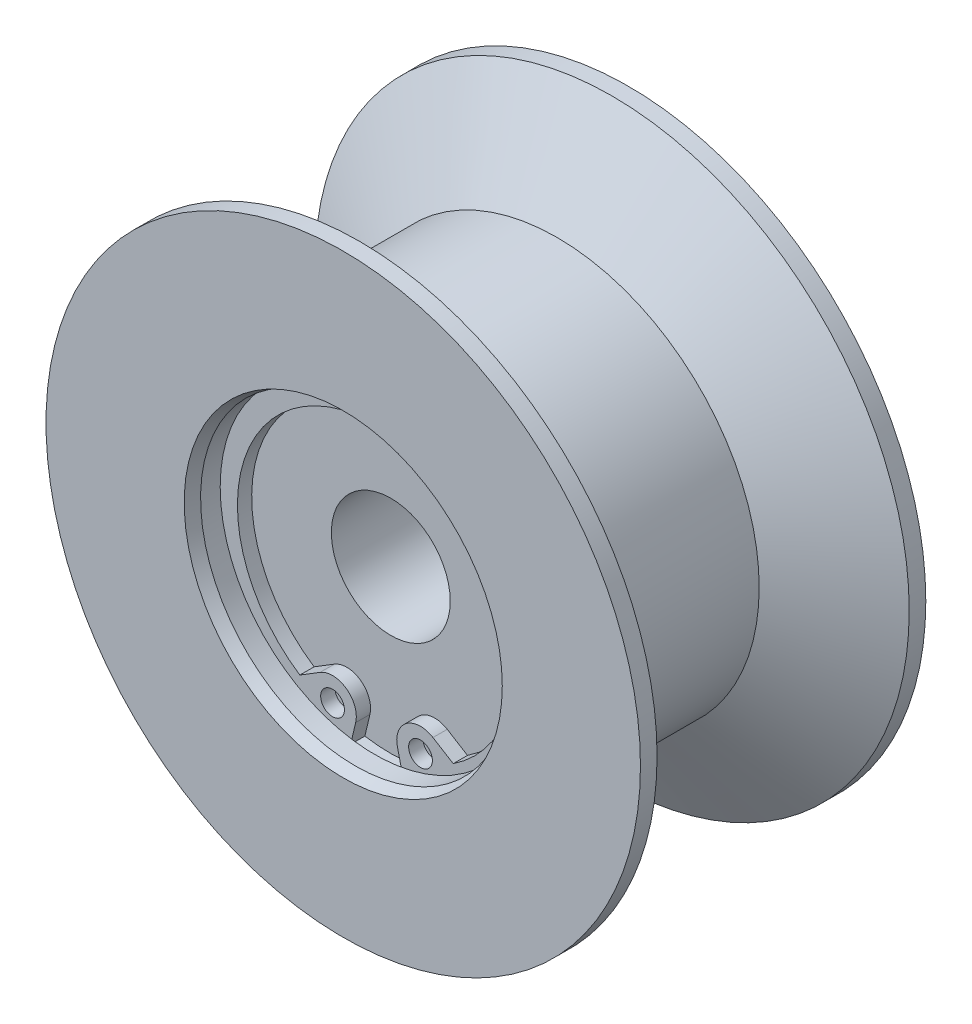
ISO-10303-21;
HEADER;
FILE_DESCRIPTION(('STEP AP214'),'2;1');
FILE_NAME('part.step','',(''),(''),'','','');
FILE_SCHEMA(('AUTOMOTIVE_DESIGN { 1 0 10303 214 1 1 1 1 }'));
ENDSEC;
DATA;
#1=APPLICATION_CONTEXT('core data for automotive mechanical design processes');
#2=APPLICATION_PROTOCOL_DEFINITION('international standard','automotive_design',2000,#1);
#3=PRODUCT_CONTEXT('',#1,'mechanical');
#4=PRODUCT('Part','Part','',(#3));
#5=PRODUCT_RELATED_PRODUCT_CATEGORY('part','',(#4));
#6=PRODUCT_DEFINITION_FORMATION('','',#4);
#7=PRODUCT_DEFINITION_CONTEXT('part definition',#1,'design');
#8=PRODUCT_DEFINITION('design','',#6,#7);
#9=PRODUCT_DEFINITION_SHAPE('','',#8);
#10=(LENGTH_UNIT() NAMED_UNIT(*) SI_UNIT(.MILLI.,.METRE.));
#11=(NAMED_UNIT(*) PLANE_ANGLE_UNIT() SI_UNIT($,.RADIAN.));
#12=(NAMED_UNIT(*) SI_UNIT($,.STERADIAN.) SOLID_ANGLE_UNIT());
#13=UNCERTAINTY_MEASURE_WITH_UNIT(LENGTH_MEASURE(1.E-05),#10,'distance_accuracy_value','');
#14=(GEOMETRIC_REPRESENTATION_CONTEXT(3) GLOBAL_UNCERTAINTY_ASSIGNED_CONTEXT((#13)) GLOBAL_UNIT_ASSIGNED_CONTEXT((#10,
#11,#12)) REPRESENTATION_CONTEXT('',''));
#15=CARTESIAN_POINT('',(0.,0.,0.));
#16=DIRECTION('',(0.,0.,1.));
#17=DIRECTION('',(1.,0.,0.));
#18=AXIS2_PLACEMENT_3D('',#15,#16,#17);
#19=CARTESIAN_POINT('',(-13.81055875,-13.7632,8.));
#20=DIRECTION('',(0.,0.,-1.));
#21=DIRECTION('',(0.,1.,0.));
#22=AXIS2_PLACEMENT_3D('',#19,#20,#21);
#23=PLANE('',#22);
#24=CARTESIAN_POINT('',(3.7,-11.165302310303,8.));
#25=DIRECTION('',(0.,0.,1.));
#26=DIRECTION('',(1.,0.,0.));
#27=AXIS2_PLACEMENT_3D('',#24,#25,#26);
#28=CIRCLE('',#27,1.);
#29=CARTESIAN_POINT('',(4.7,-11.165302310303,8.));
#30=VERTEX_POINT('',#29);
#31=EDGE_CURVE('E117',#30,#30,#28,.T.);
#32=ORIENTED_EDGE('',*,*,#31,.T.);
#33=EDGE_LOOP('',(#32));
#34=FACE_BOUND('',#33,.T.);
#35=ADVANCED_FACE('F14',(#34),#23,.F.);
#36=CARTESIAN_POINT('',(-3.7,-11.165302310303,8.));
#37=DIRECTION('',(0.,0.,-1.));
#38=DIRECTION('',(1.,0.,0.));
#39=AXIS2_PLACEMENT_3D('',#36,#37,#38);
#40=CIRCLE('',#39,1.);
#41=CARTESIAN_POINT('',(-2.7,-11.165302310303,8.));
#42=VERTEX_POINT('',#41);
#43=EDGE_CURVE('E142',#42,#42,#40,.T.);
#44=ORIENTED_EDGE('',*,*,#43,.F.);
#45=EDGE_LOOP('',(#44));
#46=FACE_BOUND('',#45,.T.);
#47=ADVANCED_FACE('F276',(#46),#23,.F.);
#48=CARTESIAN_POINT('',(0.,0.,-5.984827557));
#49=DIRECTION('',(0.,0.,1.));
#50=DIRECTION('',(1.,0.,0.));
#51=AXIS2_PLACEMENT_3D('',#48,#49,#50);
#52=CYLINDRICAL_SURFACE('',#51,16.99995471);
#53=CARTESIAN_POINT('',(0.,0.,5.984827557));
#54=DIRECTION('',(0.,0.,1.));
#55=DIRECTION('',(0.,-1.,0.));
#56=AXIS2_PLACEMENT_3D('',#53,#54,#55);
#57=CIRCLE('',#56,16.99995471);
#58=CARTESIAN_POINT('',(0.,-16.99995471,5.984827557));
#59=VERTEX_POINT('',#58);
#60=EDGE_CURVE('E175',#59,#59,#57,.F.);
#61=ORIENTED_EDGE('',*,*,#60,.T.);
#62=EDGE_LOOP('',(#61));
#63=FACE_BOUND('',#62,.T.);
#64=CARTESIAN_POINT('',(0.,0.,-5.98482755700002));
#65=DIRECTION('',(0.,0.,-1.));
#66=DIRECTION('',(0.,1.,0.));
#67=AXIS2_PLACEMENT_3D('',#64,#65,#66);
#68=CIRCLE('',#67,16.99995471);
#69=CARTESIAN_POINT('',(0.,16.99995471,-5.984827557));
#70=VERTEX_POINT('',#69);
#71=EDGE_CURVE('E182',#70,#70,#68,.T.);
#72=ORIENTED_EDGE('',*,*,#71,.F.);
#73=EDGE_LOOP('',(#72));
#74=FACE_BOUND('',#73,.T.);
#75=ADVANCED_FACE('F287',(#63,#74),#52,.T.);
#76=CARTESIAN_POINT('',(0.,0.,5.984827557));
#77=DIRECTION('',(0.,0.,1.));
#78=DIRECTION('',(1.,0.,0.));
#79=AXIS2_PLACEMENT_3D('',#76,#77,#78);
#80=CONICAL_SURFACE('',#79,16.99995471,1.04719755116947);
#81=CARTESIAN_POINT('',(0.,0.,10.6036558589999));
#82=DIRECTION('',(0.,0.,1.));
#83=DIRECTION('',(0.,-1.,0.));
#84=AXIS2_PLACEMENT_3D('',#81,#82,#83);
#85=CIRCLE('',#84,25.);
#86=CARTESIAN_POINT('',(0.,-25.,10.603655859));
#87=VERTEX_POINT('',#86);
#88=EDGE_CURVE('E185',#87,#87,#85,.F.);
#89=ORIENTED_EDGE('',*,*,#88,.T.);
#90=EDGE_LOOP('',(#89));
#91=FACE_BOUND('',#90,.T.);
#92=ORIENTED_EDGE('',*,*,#60,.F.);
#93=EDGE_LOOP('',(#92));
#94=FACE_BOUND('',#93,.T.);
#95=ADVANCED_FACE('F324',(#91,#94),#80,.T.);
#96=CARTESIAN_POINT('',(0.,0.,-5.984827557));
#97=DIRECTION('',(0.,0.,-1.));
#98=DIRECTION('',(-1.,0.,0.));
#99=AXIS2_PLACEMENT_3D('',#96,#97,#98);
#100=CONICAL_SURFACE('',#99,16.99995471,1.04719755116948);
#101=CARTESIAN_POINT('',(0.,0.,-10.6036558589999));
#102=DIRECTION('',(0.,0.,-1.));
#103=DIRECTION('',(0.,1.,0.));
#104=AXIS2_PLACEMENT_3D('',#101,#102,#103);
#105=CIRCLE('',#104,25.);
#106=CARTESIAN_POINT('',(0.,25.,-10.603655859));
#107=VERTEX_POINT('',#106);
#108=EDGE_CURVE('E143',#107,#107,#105,.F.);
#109=ORIENTED_EDGE('',*,*,#108,.T.);
#110=EDGE_LOOP('',(#109));
#111=FACE_BOUND('',#110,.T.);
#112=ORIENTED_EDGE('',*,*,#71,.T.);
#113=EDGE_LOOP('',(#112));
#114=FACE_BOUND('',#113,.T.);
#115=ADVANCED_FACE('F319',(#111,#114),#100,.T.);
#116=CARTESIAN_POINT('',(0.,0.,10.603655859));
#117=DIRECTION('',(0.,0.,1.));
#118=DIRECTION('',(1.,0.,0.));
#119=AXIS2_PLACEMENT_3D('',#116,#117,#118);
#120=CYLINDRICAL_SURFACE('',#119,25.);
#121=CARTESIAN_POINT('',(0.,0.,12.));
#122=DIRECTION('',(0.,0.,1.));
#123=DIRECTION('',(1.,0.,0.));
#124=AXIS2_PLACEMENT_3D('',#121,#122,#123);
#125=CIRCLE('',#124,25.);
#126=CARTESIAN_POINT('',(25.,0.,12.));
#127=VERTEX_POINT('',#126);
#128=EDGE_CURVE('E200',#127,#127,#125,.F.);
#129=ORIENTED_EDGE('',*,*,#128,.T.);
#130=EDGE_LOOP('',(#129));
#131=FACE_BOUND('',#130,.T.);
#132=ORIENTED_EDGE('',*,*,#88,.F.);
#133=EDGE_LOOP('',(#132));
#134=FACE_BOUND('',#133,.T.);
#135=ADVANCED_FACE('F315',(#131,#134),#120,.T.);
#136=CARTESIAN_POINT('',(0.,0.,-12.));
#137=DIRECTION('',(0.,0.,1.));
#138=DIRECTION('',(1.,0.,0.));
#139=AXIS2_PLACEMENT_3D('',#136,#137,#138);
#140=CYLINDRICAL_SURFACE('',#139,25.);
#141=ORIENTED_EDGE('',*,*,#108,.F.);
#142=EDGE_LOOP('',(#141));
#143=FACE_BOUND('',#142,.T.);
#144=CARTESIAN_POINT('',(0.,0.,-12.));
#145=DIRECTION('',(0.,0.,1.));
#146=DIRECTION('',(1.,0.,0.));
#147=AXIS2_PLACEMENT_3D('',#144,#145,#146);
#148=CIRCLE('',#147,25.);
#149=CARTESIAN_POINT('',(25.,0.,-12.));
#150=VERTEX_POINT('',#149);
#151=EDGE_CURVE('E178',#150,#150,#148,.T.);
#152=ORIENTED_EDGE('',*,*,#151,.T.);
#153=EDGE_LOOP('',(#152));
#154=FACE_BOUND('',#153,.T.);
#155=ADVANCED_FACE('F318',(#143,#154),#140,.T.);
#156=CARTESIAN_POINT('',(-25.387056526,-25.3,12.));
#157=DIRECTION('',(0.,0.,-1.));
#158=DIRECTION('',(0.,1.,0.));
#159=AXIS2_PLACEMENT_3D('',#156,#157,#158);
#160=PLANE('',#159);
#161=CARTESIAN_POINT('',(0.,0.,12.));
#162=DIRECTION('',(0.,0.,1.));
#163=DIRECTION('',(1.,0.,0.));
#164=AXIS2_PLACEMENT_3D('',#161,#162,#163);
#165=CIRCLE('',#164,13.377350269);
#166=CARTESIAN_POINT('',(13.377350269,0.,12.));
#167=VERTEX_POINT('',#166);
#168=EDGE_CURVE('E206',#167,#167,#165,.T.);
#169=ORIENTED_EDGE('',*,*,#168,.F.);
#170=EDGE_LOOP('',(#169));
#171=FACE_BOUND('',#170,.T.);
#172=ORIENTED_EDGE('',*,*,#128,.F.);
#173=EDGE_LOOP('',(#172));
#174=FACE_BOUND('',#173,.T.);
#175=ADVANCED_FACE('F333',(#171,#174),#160,.F.);
#176=CARTESIAN_POINT('',(-25.387056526,25.3,-12.));
#177=DIRECTION('',(0.,0.,1.));
#178=DIRECTION('',(0.,-1.,0.));
#179=AXIS2_PLACEMENT_3D('',#176,#177,#178);
#180=PLANE('',#179);
#181=CARTESIAN_POINT('',(0.,0.,-12.));
#182=DIRECTION('',(0.,0.,1.));
#183=DIRECTION('',(1.,0.,0.));
#184=AXIS2_PLACEMENT_3D('',#181,#182,#183);
#185=CIRCLE('',#184,11.);
#186=CARTESIAN_POINT('',(11.,0.,-12.));
#187=VERTEX_POINT('',#186);
#188=EDGE_CURVE('E179',#187,#187,#185,.F.);
#189=ORIENTED_EDGE('',*,*,#188,.F.);
#190=EDGE_LOOP('',(#189));
#191=FACE_BOUND('',#190,.T.);
#192=ORIENTED_EDGE('',*,*,#151,.F.);
#193=EDGE_LOOP('',(#192));
#194=FACE_BOUND('',#193,.T.);
#195=ADVANCED_FACE('F16',(#191,#194),#180,.F.);
#196=CARTESIAN_POINT('',(0.,0.,11.));
#197=DIRECTION('',(0.,0.,1.));
#198=DIRECTION('',(1.,0.,0.));
#199=AXIS2_PLACEMENT_3D('',#196,#197,#198);
#200=CONICAL_SURFACE('',#199,13.,0.360829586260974);
#201=CARTESIAN_POINT('',(0.,0.,11.));
#202=DIRECTION('',(0.,0.,1.));
#203=DIRECTION('',(0.,-1.,0.));
#204=AXIS2_PLACEMENT_3D('',#201,#202,#203);
#205=CIRCLE('',#204,13.);
#206=CARTESIAN_POINT('',(0.,-13.,11.));
#207=VERTEX_POINT('',#206);
#208=EDGE_CURVE('E189',#207,#207,#205,.T.);
#209=ORIENTED_EDGE('',*,*,#208,.F.);
#210=EDGE_LOOP('',(#209));
#211=FACE_BOUND('',#210,.T.);
#212=ORIENTED_EDGE('',*,*,#168,.T.);
#213=EDGE_LOOP('',(#212));
#214=FACE_BOUND('',#213,.T.);
#215=ADVANCED_FACE('F308',(#211,#214),#200,.F.);
#216=CARTESIAN_POINT('',(0.,0.,-12.));
#217=DIRECTION('',(0.,0.,1.));
#218=DIRECTION('',(1.,0.,0.));
#219=AXIS2_PLACEMENT_3D('',#216,#217,#218);
#220=CYLINDRICAL_SURFACE('',#219,11.);
#221=ORIENTED_EDGE('',*,*,#188,.T.);
#222=EDGE_LOOP('',(#221));
#223=FACE_BOUND('',#222,.T.);
#224=CARTESIAN_POINT('',(0.,0.,-8.));
#225=DIRECTION('',(0.,0.,1.));
#226=DIRECTION('',(1.,0.,0.));
#227=AXIS2_PLACEMENT_3D('',#224,#225,#226);
#228=CIRCLE('',#227,11.);
#229=CARTESIAN_POINT('',(11.,0.,-8.));
#230=VERTEX_POINT('',#229);
#231=EDGE_CURVE('E188',#230,#230,#228,.F.);
#232=ORIENTED_EDGE('',*,*,#231,.F.);
#233=EDGE_LOOP('',(#232));
#234=FACE_BOUND('',#233,.T.);
#235=ADVANCED_FACE('F306',(#223,#234),#220,.F.);
#236=CARTESIAN_POINT('',(0.,0.,9.35));
#237=DIRECTION('',(0.,0.,1.));
#238=DIRECTION('',(1.,0.,0.));
#239=AXIS2_PLACEMENT_3D('',#236,#237,#238);
#240=CYLINDRICAL_SURFACE('',#239,13.);
#241=CARTESIAN_POINT('',(0.,0.,9.35));
#242=DIRECTION('',(0.,0.,1.));
#243=DIRECTION('',(1.,0.,0.));
#244=AXIS2_PLACEMENT_3D('',#241,#242,#243);
#245=CIRCLE('',#244,13.);
#246=CARTESIAN_POINT('',(13.,0.,9.35));
#247=VERTEX_POINT('',#246);
#248=EDGE_CURVE('E213',#247,#247,#245,.T.);
#249=ORIENTED_EDGE('',*,*,#248,.F.);
#250=EDGE_LOOP('',(#249));
#251=FACE_BOUND('',#250,.T.);
#252=ORIENTED_EDGE('',*,*,#208,.T.);
#253=EDGE_LOOP('',(#252));
#254=FACE_BOUND('',#253,.T.);
#255=ADVANCED_FACE('F302',(#251,#254),#240,.F.);
#256=CARTESIAN_POINT('',(-11.170304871,11.132,-8.));
#257=DIRECTION('',(0.,0.,1.));
#258=DIRECTION('',(0.,-1.,0.));
#259=AXIS2_PLACEMENT_3D('',#256,#257,#258);
#260=PLANE('',#259);
#261=CARTESIAN_POINT('',(0.,0.,-8.));
#262=DIRECTION('',(0.,0.,1.));
#263=DIRECTION('',(1.,0.,0.));
#264=AXIS2_PLACEMENT_3D('',#261,#262,#263);
#265=CIRCLE('',#264,5.);
#266=CARTESIAN_POINT('',(5.,0.,-8.));
#267=VERTEX_POINT('',#266);
#268=EDGE_CURVE('E203',#267,#267,#265,.F.);
#269=ORIENTED_EDGE('',*,*,#268,.F.);
#270=EDGE_LOOP('',(#269));
#271=FACE_BOUND('',#270,.T.);
#272=ORIENTED_EDGE('',*,*,#231,.T.);
#273=EDGE_LOOP('',(#272));
#274=FACE_BOUND('',#273,.T.);
#275=ADVANCED_FACE('F305',(#271,#274),#260,.F.);
#276=CARTESIAN_POINT('',(-13.81055875,13.7632,9.35));
#277=DIRECTION('',(0.,0.,1.));
#278=DIRECTION('',(0.,-1.,0.));
#279=AXIS2_PLACEMENT_3D('',#276,#277,#278);
#280=PLANE('',#279);
#281=ORIENTED_EDGE('',*,*,#248,.T.);
#282=EDGE_LOOP('',(#281));
#283=FACE_BOUND('',#282,.T.);
#284=CARTESIAN_POINT('',(0.,0.,9.35));
#285=DIRECTION('',(0.,0.,1.));
#286=DIRECTION('',(1.,0.,0.));
#287=AXIS2_PLACEMENT_3D('',#284,#285,#286);
#288=CIRCLE('',#287,13.6);
#289=CARTESIAN_POINT('',(13.6,0.,9.35));
#290=VERTEX_POINT('',#289);
#291=EDGE_CURVE('E216',#290,#290,#288,.F.);
#292=ORIENTED_EDGE('',*,*,#291,.T.);
#293=EDGE_LOOP('',(#292));
#294=FACE_BOUND('',#293,.T.);
#295=ADVANCED_FACE('F220',(#283,#294),#280,.F.);
#296=CARTESIAN_POINT('',(0.,0.,8.));
#297=DIRECTION('',(0.,0.,1.));
#298=DIRECTION('',(1.,0.,0.));
#299=AXIS2_PLACEMENT_3D('',#296,#297,#298);
#300=CYLINDRICAL_SURFACE('',#299,13.6);
#301=ORIENTED_EDGE('',*,*,#291,.F.);
#302=EDGE_LOOP('',(#301));
#303=FACE_BOUND('',#302,.T.);
#304=DIRECTION('',(0.,0.,1.));
#305=VECTOR('',#304,1.);
#306=CARTESIAN_POINT('',(2.1813307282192,-13.4239262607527,8.));
#307=LINE('',#306,#305);
#308=CARTESIAN_POINT('',(2.1813307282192,-13.4239262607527,8.));
#309=VERTEX_POINT('',#308);
#310=CARTESIAN_POINT('',(2.18133072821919,-13.4239262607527,9.2));
#311=VERTEX_POINT('',#310);
#312=EDGE_CURVE('E18',#309,#311,#307,.T.);
#313=ORIENTED_EDGE('',*,*,#312,.F.);
#314=CARTESIAN_POINT('',(0.,0.,8.));
#315=DIRECTION('',(0.,0.,1.));
#316=DIRECTION('',(1.,0.,0.));
#317=AXIS2_PLACEMENT_3D('',#314,#315,#316);
#318=CIRCLE('',#317,13.6);
#319=CARTESIAN_POINT('',(-2.18133072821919,-13.4239262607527,8.));
#320=VERTEX_POINT('',#319);
#321=EDGE_CURVE('E193',#309,#320,#318,.F.);
#322=ORIENTED_EDGE('',*,*,#321,.T.);
#323=DIRECTION('',(0.,0.,1.));
#324=VECTOR('',#323,1.);
#325=CARTESIAN_POINT('',(-2.18133072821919,-13.4239262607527,8.));
#326=LINE('',#325,#324);
#327=CARTESIAN_POINT('',(-2.18133072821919,-13.4239262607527,9.2));
#328=VERTEX_POINT('',#327);
#329=EDGE_CURVE('E105',#328,#320,#326,.F.);
#330=ORIENTED_EDGE('',*,*,#329,.F.);
#331=CARTESIAN_POINT('',(0.,0.,9.2));
#332=DIRECTION('',(0.,0.,-1.));
#333=DIRECTION('',(-1.,0.,0.));
#334=AXIS2_PLACEMENT_3D('',#331,#332,#333);
#335=CIRCLE('',#334,13.6);
#336=EDGE_CURVE('E9',#311,#328,#335,.F.);
#337=ORIENTED_EDGE('',*,*,#336,.F.);
#338=EDGE_LOOP('',(#313,#322,#330,#337));
#339=FACE_BOUND('',#338,.T.);
#340=ADVANCED_FACE('F222',(#303,#339),#300,.F.);
#341=CARTESIAN_POINT('',(0.,0.,-8.));
#342=DIRECTION('',(0.,0.,1.));
#343=DIRECTION('',(1.,0.,0.));
#344=AXIS2_PLACEMENT_3D('',#341,#342,#343);
#345=CYLINDRICAL_SURFACE('',#344,5.);
#346=ORIENTED_EDGE('',*,*,#268,.T.);
#347=EDGE_LOOP('',(#346));
#348=FACE_BOUND('',#347,.T.);
#349=CARTESIAN_POINT('',(0.,0.,8.));
#350=DIRECTION('',(0.,0.,1.));
#351=DIRECTION('',(1.,0.,0.));
#352=AXIS2_PLACEMENT_3D('',#349,#350,#351);
#353=CIRCLE('',#352,5.);
#354=CARTESIAN_POINT('',(5.,0.,8.));
#355=VERTEX_POINT('',#354);
#356=EDGE_CURVE('E192',#355,#355,#353,.F.);
#357=ORIENTED_EDGE('',*,*,#356,.F.);
#358=EDGE_LOOP('',(#357));
#359=FACE_BOUND('',#358,.T.);
#360=ADVANCED_FACE('F224',(#348,#359),#345,.F.);
#361=ORIENTED_EDGE('',*,*,#356,.T.);
#362=EDGE_LOOP('',(#361));
#363=FACE_BOUND('',#362,.T.);
#364=ORIENTED_EDGE('',*,*,#321,.F.);
#365=DIRECTION('',(0.231349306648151,-0.972870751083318,0.));
#366=VECTOR('',#365,1.);
#367=CARTESIAN_POINT('',(1.75425849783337,-11.6280009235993,8.));
#368=LINE('',#367,#366);
#369=CARTESIAN_POINT('',(1.75425849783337,-11.6280009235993,8.));
#370=VERTEX_POINT('',#369);
#371=EDGE_CURVE('E34',#370,#309,#368,.T.);
#372=ORIENTED_EDGE('',*,*,#371,.F.);
#373=CARTESIAN_POINT('',(3.7,-11.165302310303,8.));
#374=DIRECTION('',(0.,0.,1.));
#375=DIRECTION('',(1.,0.,0.));
#376=AXIS2_PLACEMENT_3D('',#373,#374,#375);
#377=CIRCLE('',#376,2.);
#378=CARTESIAN_POINT('',(4.74866968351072,-9.46227797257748,8.));
#379=VERTEX_POINT('',#378);
#380=EDGE_CURVE('E137',#379,#370,#377,.T.);
#381=ORIENTED_EDGE('',*,*,#380,.F.);
#382=DIRECTION('',(-0.851512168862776,0.524334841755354,0.));
#383=VECTOR('',#382,1.);
#384=CARTESIAN_POINT('',(4.74866968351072,-9.46227797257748,8.));
#385=LINE('',#384,#383);
#386=CARTESIAN_POINT('',(6.45127454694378,-10.5106893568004,8.));
#387=VERTEX_POINT('',#386);
#388=EDGE_CURVE('E112',#387,#379,#385,.T.);
#389=ORIENTED_EDGE('',*,*,#388,.F.);
#390=CARTESIAN_POINT('',(0.,-0.75,8.));
#391=DIRECTION('',(0.,0.,-1.));
#392=DIRECTION('',(0.,-1.,0.));
#393=AXIS2_PLACEMENT_3D('',#390,#391,#392);
#394=CIRCLE('',#393,11.7);
#395=CARTESIAN_POINT('',(-6.45127454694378,-10.5106893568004,8.));
#396=VERTEX_POINT('',#395);
#397=EDGE_CURVE('E108',#396,#387,#394,.T.);
#398=ORIENTED_EDGE('',*,*,#397,.F.);
#399=DIRECTION('',(-0.851512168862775,-0.524334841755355,0.));
#400=VECTOR('',#399,1.);
#401=CARTESIAN_POINT('',(-4.74866968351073,-9.46227797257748,8.));
#402=LINE('',#401,#400);
#403=CARTESIAN_POINT('',(-4.74866968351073,-9.46227797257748,8.));
#404=VERTEX_POINT('',#403);
#405=EDGE_CURVE('E94',#404,#396,#402,.T.);
#406=ORIENTED_EDGE('',*,*,#405,.F.);
#407=CARTESIAN_POINT('',(-3.7,-11.165302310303,8.));
#408=DIRECTION('',(0.,0.,1.));
#409=DIRECTION('',(-1.,0.,0.));
#410=AXIS2_PLACEMENT_3D('',#407,#408,#409);
#411=CIRCLE('',#410,2.);
#412=CARTESIAN_POINT('',(-1.75425849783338,-11.6280009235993,8.));
#413=VERTEX_POINT('',#412);
#414=EDGE_CURVE('E148',#413,#404,#411,.T.);
#415=ORIENTED_EDGE('',*,*,#414,.F.);
#416=DIRECTION('',(0.231349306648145,0.97287075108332,0.));
#417=VECTOR('',#416,1.);
#418=CARTESIAN_POINT('',(-1.75425849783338,-11.6280009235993,8.));
#419=LINE('',#418,#417);
#420=EDGE_CURVE('E144',#320,#413,#419,.T.);
#421=ORIENTED_EDGE('',*,*,#420,.F.);
#422=EDGE_LOOP('',(#364,#372,#381,#389,#398,#406,#415,#421));
#423=FACE_BOUND('',#422,.T.);
#424=ADVANCED_FACE('F110',(#363,#423),#23,.F.);
#425=CARTESIAN_POINT('',(0.,-0.75,9.2));
#426=DIRECTION('',(0.,0.,1.));
#427=DIRECTION('',(-1.,0.,0.));
#428=AXIS2_PLACEMENT_3D('',#425,#426,#427);
#429=CYLINDRICAL_SURFACE('',#428,11.7);
#430=ORIENTED_EDGE('',*,*,#397,.T.);
#431=DIRECTION('',(0.,0.,-1.));
#432=VECTOR('',#431,1.);
#433=CARTESIAN_POINT('',(6.45127454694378,-10.5106893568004,9.2));
#434=LINE('',#433,#432);
#435=CARTESIAN_POINT('',(6.45127454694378,-10.5106893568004,9.2));
#436=VERTEX_POINT('',#435);
#437=EDGE_CURVE('E127',#436,#387,#434,.T.);
#438=ORIENTED_EDGE('',*,*,#437,.F.);
#439=CARTESIAN_POINT('',(0.,-0.75,9.2));
#440=DIRECTION('',(0.,0.,-1.));
#441=DIRECTION('',(0.,-1.,0.));
#442=AXIS2_PLACEMENT_3D('',#439,#440,#441);
#443=CIRCLE('',#442,11.7);
#444=CARTESIAN_POINT('',(-6.45127454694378,-10.5106893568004,9.2));
#445=VERTEX_POINT('',#444);
#446=EDGE_CURVE('E120',#445,#436,#443,.T.);
#447=ORIENTED_EDGE('',*,*,#446,.F.);
#448=DIRECTION('',(0.,0.,-1.));
#449=VECTOR('',#448,1.);
#450=CARTESIAN_POINT('',(-6.45127454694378,-10.5106893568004,9.2));
#451=LINE('',#450,#449);
#452=EDGE_CURVE('E98',#445,#396,#451,.T.);
#453=ORIENTED_EDGE('',*,*,#452,.T.);
#454=EDGE_LOOP('',(#430,#438,#447,#453));
#455=FACE_BOUND('',#454,.T.);
#456=ADVANCED_FACE('F119',(#455),#429,.F.);
#457=CARTESIAN_POINT('',(4.74866968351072,-9.46227797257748,9.2));
#458=DIRECTION('',(-0.524334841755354,-0.851512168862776,0.));
#459=DIRECTION('',(-0.851512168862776,0.524334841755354,0.));
#460=AXIS2_PLACEMENT_3D('',#457,#458,#459);
#461=PLANE('',#460);
#462=ORIENTED_EDGE('',*,*,#388,.T.);
#463=DIRECTION('',(0.,0.,-1.));
#464=VECTOR('',#463,1.);
#465=CARTESIAN_POINT('',(4.74866968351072,-9.46227797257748,9.2));
#466=LINE('',#465,#464);
#467=CARTESIAN_POINT('',(4.74866968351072,-9.46227797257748,9.2));
#468=VERTEX_POINT('',#467);
#469=EDGE_CURVE('E155',#468,#379,#466,.T.);
#470=ORIENTED_EDGE('',*,*,#469,.F.);
#471=DIRECTION('',(-0.851512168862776,0.524334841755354,0.));
#472=VECTOR('',#471,1.);
#473=CARTESIAN_POINT('',(4.74866968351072,-9.46227797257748,9.2));
#474=LINE('',#473,#472);
#475=EDGE_CURVE('E131',#436,#468,#474,.T.);
#476=ORIENTED_EDGE('',*,*,#475,.F.);
#477=ORIENTED_EDGE('',*,*,#437,.T.);
#478=EDGE_LOOP('',(#462,#470,#476,#477));
#479=FACE_BOUND('',#478,.T.);
#480=ADVANCED_FACE('F294',(#479),#461,.F.);
#481=CARTESIAN_POINT('',(3.7,-11.165302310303,9.2));
#482=DIRECTION('',(0.,0.,1.));
#483=DIRECTION('',(-1.,0.,0.));
#484=AXIS2_PLACEMENT_3D('',#481,#482,#483);
#485=CYLINDRICAL_SURFACE('',#484,2.);
#486=ORIENTED_EDGE('',*,*,#380,.T.);
#487=DIRECTION('',(0.,0.,-1.));
#488=VECTOR('',#487,1.);
#489=CARTESIAN_POINT('',(1.75425849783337,-11.6280009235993,9.2));
#490=LINE('',#489,#488);
#491=CARTESIAN_POINT('',(1.75425849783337,-11.6280009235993,9.2));
#492=VERTEX_POINT('',#491);
#493=EDGE_CURVE('E147',#492,#370,#490,.T.);
#494=ORIENTED_EDGE('',*,*,#493,.F.);
#495=CARTESIAN_POINT('',(3.7,-11.165302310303,9.2));
#496=DIRECTION('',(0.,0.,1.));
#497=DIRECTION('',(1.,0.,0.));
#498=AXIS2_PLACEMENT_3D('',#495,#496,#497);
#499=CIRCLE('',#498,2.);
#500=EDGE_CURVE('E165',#468,#492,#499,.T.);
#501=ORIENTED_EDGE('',*,*,#500,.F.);
#502=ORIENTED_EDGE('',*,*,#469,.T.);
#503=EDGE_LOOP('',(#486,#494,#501,#502));
#504=FACE_BOUND('',#503,.T.);
#505=ADVANCED_FACE('F241',(#504),#485,.T.);
#506=CARTESIAN_POINT('',(-1.75425849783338,-11.6280009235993,9.2));
#507=DIRECTION('',(-0.97287075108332,0.231349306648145,0.));
#508=DIRECTION('',(0.,0.,1.));
#509=AXIS2_PLACEMENT_3D('',#506,#507,#508);
#510=PLANE('',#509);
#511=DIRECTION('',(0.231349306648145,0.97287075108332,0.));
#512=VECTOR('',#511,1.);
#513=CARTESIAN_POINT('',(-1.75425849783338,-11.6280009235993,9.2));
#514=LINE('',#513,#512);
#515=CARTESIAN_POINT('',(-1.75425849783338,-11.6280009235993,9.2));
#516=VERTEX_POINT('',#515);
#517=EDGE_CURVE('E149',#328,#516,#514,.T.);
#518=ORIENTED_EDGE('',*,*,#517,.F.);
#519=ORIENTED_EDGE('',*,*,#329,.T.);
#520=ORIENTED_EDGE('',*,*,#420,.T.);
#521=DIRECTION('',(0.,0.,-1.));
#522=VECTOR('',#521,1.);
#523=CARTESIAN_POINT('',(-1.75425849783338,-11.6280009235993,9.2));
#524=LINE('',#523,#522);
#525=EDGE_CURVE('E158',#516,#413,#524,.T.);
#526=ORIENTED_EDGE('',*,*,#525,.F.);
#527=EDGE_LOOP('',(#518,#519,#520,#526));
#528=FACE_BOUND('',#527,.T.);
#529=ADVANCED_FACE('F230',(#528),#510,.F.);
#530=CARTESIAN_POINT('',(0.,-0.75,9.2));
#531=DIRECTION('',(0.,0.,-1.));
#532=DIRECTION('',(0.,-1.,0.));
#533=AXIS2_PLACEMENT_3D('',#530,#531,#532);
#534=PLANE('',#533);
#535=CARTESIAN_POINT('',(-3.7,-11.165302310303,9.2));
#536=DIRECTION('',(0.,0.,-1.));
#537=DIRECTION('',(1.,0.,0.));
#538=AXIS2_PLACEMENT_3D('',#535,#536,#537);
#539=CIRCLE('',#538,1.);
#540=CARTESIAN_POINT('',(-2.7,-11.165302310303,9.2));
#541=VERTEX_POINT('',#540);
#542=EDGE_CURVE('E133',#541,#541,#539,.T.);
#543=ORIENTED_EDGE('',*,*,#542,.T.);
#544=EDGE_LOOP('',(#543));
#545=FACE_BOUND('',#544,.T.);
#546=CARTESIAN_POINT('',(3.7,-11.165302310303,9.2));
#547=DIRECTION('',(0.,0.,1.));
#548=DIRECTION('',(1.,0.,0.));
#549=AXIS2_PLACEMENT_3D('',#546,#547,#548);
#550=CIRCLE('',#549,1.);
#551=CARTESIAN_POINT('',(4.7,-11.165302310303,9.2));
#552=VERTEX_POINT('',#551);
#553=EDGE_CURVE('E138',#552,#552,#550,.T.);
#554=ORIENTED_EDGE('',*,*,#553,.F.);
#555=EDGE_LOOP('',(#554));
#556=FACE_BOUND('',#555,.T.);
#557=DIRECTION('',(0.231349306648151,-0.972870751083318,0.));
#558=VECTOR('',#557,1.);
#559=CARTESIAN_POINT('',(1.75425849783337,-11.6280009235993,9.2));
#560=LINE('',#559,#558);
#561=EDGE_CURVE('E152',#492,#311,#560,.T.);
#562=ORIENTED_EDGE('',*,*,#561,.T.);
#563=ORIENTED_EDGE('',*,*,#336,.T.);
#564=ORIENTED_EDGE('',*,*,#517,.T.);
#565=CARTESIAN_POINT('',(-3.7,-11.165302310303,9.2));
#566=DIRECTION('',(0.,0.,1.));
#567=DIRECTION('',(-1.,0.,0.));
#568=AXIS2_PLACEMENT_3D('',#565,#566,#567);
#569=CIRCLE('',#568,2.);
#570=CARTESIAN_POINT('',(-4.74866968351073,-9.46227797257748,9.2));
#571=VERTEX_POINT('',#570);
#572=EDGE_CURVE('E136',#516,#571,#569,.T.);
#573=ORIENTED_EDGE('',*,*,#572,.T.);
#574=DIRECTION('',(-0.851512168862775,-0.524334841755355,0.));
#575=VECTOR('',#574,1.);
#576=CARTESIAN_POINT('',(-4.74866968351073,-9.46227797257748,9.2));
#577=LINE('',#576,#575);
#578=EDGE_CURVE('E251',#571,#445,#577,.T.);
#579=ORIENTED_EDGE('',*,*,#578,.T.);
#580=ORIENTED_EDGE('',*,*,#446,.T.);
#581=ORIENTED_EDGE('',*,*,#475,.T.);
#582=ORIENTED_EDGE('',*,*,#500,.T.);
#583=EDGE_LOOP('',(#562,#563,#564,#573,#579,#580,#581,#582));
#584=FACE_BOUND('',#583,.T.);
#585=ADVANCED_FACE('F232',(#545,#556,#584),#534,.F.);
#586=CARTESIAN_POINT('',(3.7,-11.165302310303,9.2));
#587=DIRECTION('',(0.,0.,1.));
#588=DIRECTION('',(-1.,0.,0.));
#589=AXIS2_PLACEMENT_3D('',#586,#587,#588);
#590=CYLINDRICAL_SURFACE('',#589,1.);
#591=ORIENTED_EDGE('',*,*,#31,.F.);
#592=EDGE_LOOP('',(#591));
#593=FACE_BOUND('',#592,.T.);
#594=ORIENTED_EDGE('',*,*,#553,.T.);
#595=EDGE_LOOP('',(#594));
#596=FACE_BOUND('',#595,.T.);
#597=ADVANCED_FACE('F463',(#593,#596),#590,.F.);
#598=CARTESIAN_POINT('',(-3.7,-11.165302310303,9.2));
#599=DIRECTION('',(0.,0.,1.));
#600=DIRECTION('',(-1.,0.,0.));
#601=AXIS2_PLACEMENT_3D('',#598,#599,#600);
#602=CYLINDRICAL_SURFACE('',#601,1.);
#603=ORIENTED_EDGE('',*,*,#43,.T.);
#604=EDGE_LOOP('',(#603));
#605=FACE_BOUND('',#604,.T.);
#606=ORIENTED_EDGE('',*,*,#542,.F.);
#607=EDGE_LOOP('',(#606));
#608=FACE_BOUND('',#607,.T.);
#609=ADVANCED_FACE('F277',(#605,#608),#602,.F.);
#610=CARTESIAN_POINT('',(-4.74866968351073,-9.46227797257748,9.2));
#611=DIRECTION('',(0.524334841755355,-0.851512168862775,0.));
#612=DIRECTION('',(0.,0.,-1.));
#613=AXIS2_PLACEMENT_3D('',#610,#611,#612);
#614=PLANE('',#613);
#615=ORIENTED_EDGE('',*,*,#405,.T.);
#616=ORIENTED_EDGE('',*,*,#452,.F.);
#617=ORIENTED_EDGE('',*,*,#578,.F.);
#618=DIRECTION('',(0.,0.,-1.));
#619=VECTOR('',#618,1.);
#620=CARTESIAN_POINT('',(-4.74866968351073,-9.46227797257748,9.2));
#621=LINE('',#620,#619);
#622=EDGE_CURVE('E101',#571,#404,#621,.T.);
#623=ORIENTED_EDGE('',*,*,#622,.T.);
#624=EDGE_LOOP('',(#615,#616,#617,#623));
#625=FACE_BOUND('',#624,.T.);
#626=ADVANCED_FACE('F96',(#625),#614,.F.);
#627=CARTESIAN_POINT('',(-3.7,-11.165302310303,9.2));
#628=DIRECTION('',(0.,0.,1.));
#629=DIRECTION('',(-1.,0.,0.));
#630=AXIS2_PLACEMENT_3D('',#627,#628,#629);
#631=CYLINDRICAL_SURFACE('',#630,2.);
#632=ORIENTED_EDGE('',*,*,#414,.T.);
#633=ORIENTED_EDGE('',*,*,#622,.F.);
#634=ORIENTED_EDGE('',*,*,#572,.F.);
#635=ORIENTED_EDGE('',*,*,#525,.T.);
#636=EDGE_LOOP('',(#632,#633,#634,#635));
#637=FACE_BOUND('',#636,.T.);
#638=ADVANCED_FACE('F267',(#637),#631,.T.);
#639=CARTESIAN_POINT('',(1.75425849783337,-11.6280009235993,9.2));
#640=DIRECTION('',(0.972870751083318,0.231349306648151,0.));
#641=DIRECTION('',(0.,0.,-1.));
#642=AXIS2_PLACEMENT_3D('',#639,#640,#641);
#643=PLANE('',#642);
#644=ORIENTED_EDGE('',*,*,#371,.T.);
#645=ORIENTED_EDGE('',*,*,#312,.T.);
#646=ORIENTED_EDGE('',*,*,#561,.F.);
#647=ORIENTED_EDGE('',*,*,#493,.T.);
#648=EDGE_LOOP('',(#644,#645,#646,#647));
#649=FACE_BOUND('',#648,.T.);
#650=ADVANCED_FACE('F239',(#649),#643,.F.);
#651=CLOSED_SHELL('',(#35,#47,#75,#95,#115,#135,#155,#175,#195,#215,#235,#255,#275,#295,#340,
#360,#424,#456,#480,#505,#529,#585,#597,#609,#626,#638,#650));
#652=MANIFOLD_SOLID_BREP('B1',#651);
#653=ADVANCED_BREP_SHAPE_REPRESENTATION('',(#18,#652),#14);
#654=SHAPE_DEFINITION_REPRESENTATION(#9,#653);
ENDSEC;
END-ISO-10303-21;
